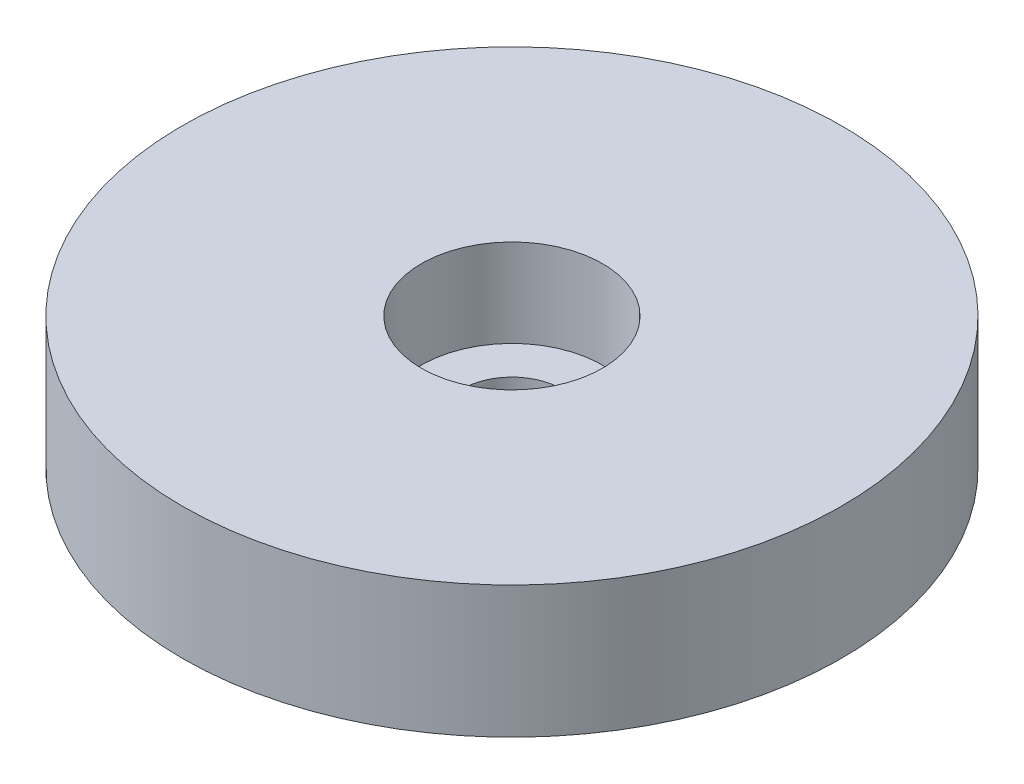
from build123d import *

# Parameters (mm, degrees)
SKETCH1_R           = 15
BOSS_EXTRUDE1_DEPTH = 6
SKETCH3_R           = 4.125
CUT_EXTRUDE2_DEPTH  = 4
SKETCH4_R           = 2.25
CUT_EXTRUDE3_DEPTH  = 23.338307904


with BuildPart() as part:
    # Sketch1 → Boss-Extrude1 (new body)
    with BuildSketch(Plane(origin=(0, 0, 0), x_dir=(1, 0, 0), z_dir=(0, 1, 0))):
        with Locations(Location((0, 0, 0), (0, 0, 270))):
            Circle(SKETCH1_R)
    extrude(amount=-BOSS_EXTRUDE1_DEPTH)

    # Sketch2 → Revolve2 (revolve)
    with BuildSketch(Plane(origin=(0, 0, 0), x_dir=(0, 0, -1), z_dir=(1, 0, 0))):
        with BuildLine():
            Line((-5, -6), (0, -6))
            Line((0, -6), (0, -11))
            ThreePointArc((0, -11), (-3.535533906, -9.535533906), (-5, -6))
        make_face()
    revolve(axis=Axis((0, -6, 0), (0, -1, 0)))

    # Sketch3 → Cut-Extrude2 (cut)
    with BuildSketch(Plane(origin=(0, 0, 0), x_dir=(1, 0, 0), z_dir=(0, 1, 0))):
        with Locations(Location((0, 0, 0), (0, 0, 270))):
            Circle(SKETCH3_R)
    extrude(amount=-CUT_EXTRUDE2_DEPTH, mode=Mode.SUBTRACT)

    # Sketch4 → Cut-Extrude3 (cut, through all)
    with BuildSketch(Plane(origin=(0, -4, 0), x_dir=(1, 0, 0), z_dir=(0, 1, 0))):
        with Locations(Location((0, 0, 0), (0, 0, 270))):
            Circle(SKETCH4_R)
    extrude(amount=-CUT_EXTRUDE3_DEPTH, mode=Mode.SUBTRACT)


solid = part.part
